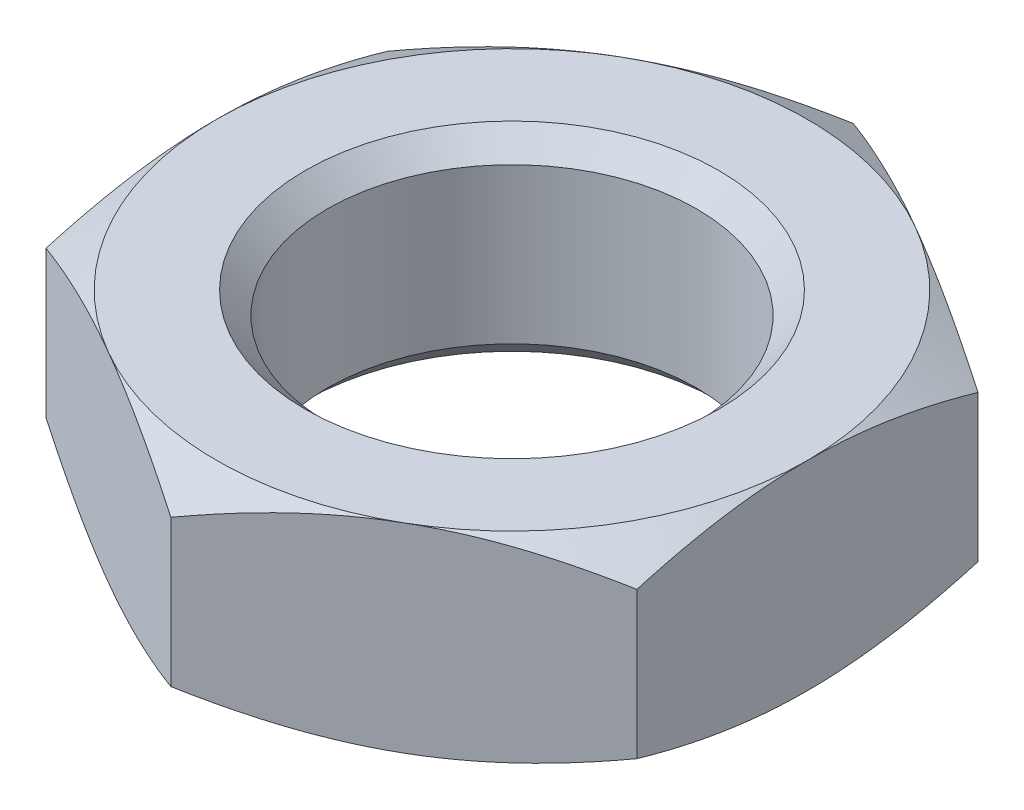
ISO-10303-21;
HEADER;
FILE_DESCRIPTION(('STEP AP214'),'2;1');
FILE_NAME('part.step','',(''),(''),'','','');
FILE_SCHEMA(('AUTOMOTIVE_DESIGN { 1 0 10303 214 1 1 1 1 }'));
ENDSEC;
DATA;
#1=APPLICATION_CONTEXT('core data for automotive mechanical design processes');
#2=APPLICATION_PROTOCOL_DEFINITION('international standard','automotive_design',2000,#1);
#3=PRODUCT_CONTEXT('',#1,'mechanical');
#4=PRODUCT('Part','Part','',(#3));
#5=PRODUCT_RELATED_PRODUCT_CATEGORY('part','',(#4));
#6=PRODUCT_DEFINITION_FORMATION('','',#4);
#7=PRODUCT_DEFINITION_CONTEXT('part definition',#1,'design');
#8=PRODUCT_DEFINITION('design','',#6,#7);
#9=PRODUCT_DEFINITION_SHAPE('','',#8);
#10=(LENGTH_UNIT() NAMED_UNIT(*) SI_UNIT(.MILLI.,.METRE.));
#11=(NAMED_UNIT(*) PLANE_ANGLE_UNIT() SI_UNIT($,.RADIAN.));
#12=(NAMED_UNIT(*) SI_UNIT($,.STERADIAN.) SOLID_ANGLE_UNIT());
#13=UNCERTAINTY_MEASURE_WITH_UNIT(LENGTH_MEASURE(1.E-05),#10,'distance_accuracy_value','');
#14=(GEOMETRIC_REPRESENTATION_CONTEXT(3) GLOBAL_UNCERTAINTY_ASSIGNED_CONTEXT((#13)) GLOBAL_UNIT_ASSIGNED_CONTEXT((#10,
#11,#12)) REPRESENTATION_CONTEXT('',''));
#15=CARTESIAN_POINT('',(0.,0.,0.));
#16=DIRECTION('',(0.,0.,1.));
#17=DIRECTION('',(1.,0.,0.));
#18=AXIS2_PLACEMENT_3D('',#15,#16,#17);
#19=CARTESIAN_POINT('',(-4.,1.35,-2.3094010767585));
#20=DIRECTION('',(0.,1.,0.));
#21=DIRECTION('',(0.,0.,1.));
#22=AXIS2_PLACEMENT_3D('',#19,#20,#21);
#23=PLANE('',#22);
#24=CARTESIAN_POINT('',(0.,1.35,0.));
#25=DIRECTION('',(0.,1.,0.));
#26=DIRECTION('',(0.,0.,1.));
#27=AXIS2_PLACEMENT_3D('',#24,#25,#26);
#28=CIRCLE('',#27,2.8);
#29=CARTESIAN_POINT('',(0.,1.35,2.8));
#30=VERTEX_POINT('',#29);
#31=EDGE_CURVE('E13',#30,#30,#28,.F.);
#32=ORIENTED_EDGE('',*,*,#31,.T.);
#33=EDGE_LOOP('',(#32));
#34=FACE_BOUND('',#33,.T.);
#35=CARTESIAN_POINT('',(0.,1.35,0.));
#36=DIRECTION('',(0.,1.,0.));
#37=DIRECTION('',(0.,0.,1.));
#38=AXIS2_PLACEMENT_3D('',#35,#36,#37);
#39=CIRCLE('',#38,4.);
#40=CARTESIAN_POINT('',(-2.,1.35,3.46410161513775));
#41=VERTEX_POINT('',#40);
#42=CARTESIAN_POINT('',(2.,1.35,3.46410161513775));
#43=VERTEX_POINT('',#42);
#44=EDGE_CURVE('E264',#41,#43,#39,.T.);
#45=ORIENTED_EDGE('',*,*,#44,.T.);
#46=CARTESIAN_POINT('',(4.,1.35,0.));
#47=VERTEX_POINT('',#46);
#48=EDGE_CURVE('E267',#43,#47,#39,.T.);
#49=ORIENTED_EDGE('',*,*,#48,.T.);
#50=CARTESIAN_POINT('',(2.,1.35,-3.46410161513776));
#51=VERTEX_POINT('',#50);
#52=EDGE_CURVE('E276',#47,#51,#39,.T.);
#53=ORIENTED_EDGE('',*,*,#52,.T.);
#54=CARTESIAN_POINT('',(-2.,1.35,-3.46410161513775));
#55=VERTEX_POINT('',#54);
#56=EDGE_CURVE('E278',#51,#55,#39,.T.);
#57=ORIENTED_EDGE('',*,*,#56,.T.);
#58=CARTESIAN_POINT('',(-4.,1.35,0.));
#59=VERTEX_POINT('',#58);
#60=EDGE_CURVE('E273',#55,#59,#39,.T.);
#61=ORIENTED_EDGE('',*,*,#60,.T.);
#62=EDGE_CURVE('E269',#59,#41,#39,.T.);
#63=ORIENTED_EDGE('',*,*,#62,.T.);
#64=EDGE_LOOP('',(#45,#49,#53,#57,#61,#63));
#65=FACE_BOUND('',#64,.T.);
#66=ADVANCED_FACE('F39',(#34,#65),#23,.T.);
#67=CARTESIAN_POINT('',(0.,1.35,-4.61880215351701));
#68=DIRECTION('',(0.5,0.,0.866025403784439));
#69=DIRECTION('',(0.866025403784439,0.,-0.5));
#70=AXIS2_PLACEMENT_3D('',#67,#68,#69);
#71=PLANE('',#70);
#72=DIRECTION('',(0.,-1.,0.));
#73=VECTOR('',#72,1.);
#74=CARTESIAN_POINT('',(0.,1.35,-4.61880215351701));
#75=LINE('',#74,#73);
#76=CARTESIAN_POINT('',(0.,0.992734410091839,-4.61880215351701));
#77=VERTEX_POINT('',#76);
#78=CARTESIAN_POINT('',(0.,-0.992734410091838,-4.61880215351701));
#79=VERTEX_POINT('',#78);
#80=EDGE_CURVE('E297',#77,#79,#75,.T.);
#81=ORIENTED_EDGE('',*,*,#80,.T.);
#82=CARTESIAN_POINT('',(0.000199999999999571,-0.992667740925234,-4.61891762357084));
#83=CARTESIAN_POINT('',(-0.175579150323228,-1.05128212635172,-4.51743148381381));
#84=CARTESIAN_POINT('',(-0.352875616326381,-1.10458967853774,-4.41506932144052));
#85=CARTESIAN_POINT('',(-0.710538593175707,-1.1976383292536,-4.20857250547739));
#86=CARTESIAN_POINT('',(-0.890911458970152,-1.2373465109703,-4.10443418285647));
#87=CARTESIAN_POINT('',(-1.24942181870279,-1.29915778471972,-3.89744813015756));
#88=CARTESIAN_POINT('',(-1.42750415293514,-1.32167226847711,-3.79463224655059));
#89=CARTESIAN_POINT('',(-1.78450671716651,-1.34854937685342,-3.58851671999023));
#90=CARTESIAN_POINT('',(-1.9634256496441,-1.35293425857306,-3.48521782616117));
#91=CARTESIAN_POINT('',(-2.29774284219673,-1.34380992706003,-3.29219970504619));
#92=CARTESIAN_POINT('',(-2.45319115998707,-1.33254104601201,-3.20245157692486));
#93=CARTESIAN_POINT('',(-2.76307505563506,-1.29682600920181,-3.02354002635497));
#94=CARTESIAN_POINT('',(-2.91750956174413,-1.27236765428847,-2.93437722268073));
#95=CARTESIAN_POINT('',(-3.22803232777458,-1.21122393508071,-2.75509682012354));
#96=CARTESIAN_POINT('',(-3.3840812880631,-1.17427939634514,-2.6650019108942));
#97=CARTESIAN_POINT('',(-3.69385183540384,-1.09042992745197,-2.48615580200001));
#98=CARTESIAN_POINT('',(-3.84757739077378,-1.04354469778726,-2.39740231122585));
#99=CARTESIAN_POINT('',(-4.0002,-0.992667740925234,-2.30928560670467));
#100=B_SPLINE_CURVE_WITH_KNOTS('',3,(#82,#83,#84,#85,#86,#87,#88,#89,#90,#91,#92,#93,#94,#95,
#96,#97,#98,#99),.UNSPECIFIED.,.F.,.F.,(4,2,2,2,2,2,2,2,4),(0.,0.634047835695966,
1.26961969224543,1.88946157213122,2.50854226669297,3.04757825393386,3.58711366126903,
4.13861653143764,4.68903648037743),.UNSPECIFIED.);
#101=CARTESIAN_POINT('',(-2.,-1.35,-3.46410161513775));
#102=VERTEX_POINT('',#101);
#103=EDGE_CURVE('E62',#79,#102,#100,.T.);
#104=ORIENTED_EDGE('',*,*,#103,.T.);
#105=CARTESIAN_POINT('',(-4.,-0.992734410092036,-2.3094010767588));
#106=VERTEX_POINT('',#105);
#107=EDGE_CURVE('E201',#102,#106,#100,.T.);
#108=ORIENTED_EDGE('',*,*,#107,.T.);
#109=DIRECTION('',(0.,-1.,0.));
#110=VECTOR('',#109,1.);
#111=CARTESIAN_POINT('',(-4.,1.35,-2.3094010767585));
#112=LINE('',#111,#110);
#113=CARTESIAN_POINT('',(-4.,0.992734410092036,-2.3094010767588));
#114=VERTEX_POINT('',#113);
#115=EDGE_CURVE('E232',#114,#106,#112,.T.);
#116=ORIENTED_EDGE('',*,*,#115,.F.);
#117=CARTESIAN_POINT('',(0.000199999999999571,0.992667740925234,-4.61891762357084));
#118=CARTESIAN_POINT('',(-0.175579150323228,1.05128212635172,-4.51743148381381));
#119=CARTESIAN_POINT('',(-0.352875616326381,1.10458967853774,-4.41506932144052));
#120=CARTESIAN_POINT('',(-0.710538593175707,1.1976383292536,-4.20857250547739));
#121=CARTESIAN_POINT('',(-0.890911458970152,1.2373465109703,-4.10443418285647));
#122=CARTESIAN_POINT('',(-1.24942181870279,1.29915778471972,-3.89744813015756));
#123=CARTESIAN_POINT('',(-1.42750415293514,1.32167226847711,-3.79463224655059));
#124=CARTESIAN_POINT('',(-1.78450671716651,1.34854937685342,-3.58851671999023));
#125=CARTESIAN_POINT('',(-1.9634256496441,1.35293425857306,-3.48521782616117));
#126=CARTESIAN_POINT('',(-2.29774284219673,1.34380992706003,-3.29219970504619));
#127=CARTESIAN_POINT('',(-2.45319115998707,1.33254104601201,-3.20245157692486));
#128=CARTESIAN_POINT('',(-2.76307505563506,1.29682600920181,-3.02354002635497));
#129=CARTESIAN_POINT('',(-2.91750956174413,1.27236765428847,-2.93437722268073));
#130=CARTESIAN_POINT('',(-3.22803232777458,1.21122393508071,-2.75509682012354));
#131=CARTESIAN_POINT('',(-3.3840812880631,1.17427939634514,-2.6650019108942));
#132=CARTESIAN_POINT('',(-3.69385183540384,1.09042992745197,-2.48615580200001));
#133=CARTESIAN_POINT('',(-3.84757739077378,1.04354469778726,-2.39740231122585));
#134=CARTESIAN_POINT('',(-4.0002,0.992667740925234,-2.30928560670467));
#135=B_SPLINE_CURVE_WITH_KNOTS('',3,(#117,#118,#119,#120,#121,#122,#123,#124,#125,#126,#127,
#128,#129,#130,#131,#132,#133,#134),.UNSPECIFIED.,.F.,.F.,(4,2,2,2,2,2,2,2,4),(0.,
0.634047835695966,1.26961969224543,1.88946157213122,2.50854226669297,3.04757825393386,
3.58711366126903,4.13861653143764,4.68903648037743),.UNSPECIFIED.);
#136=EDGE_CURVE('E286',#55,#114,#135,.T.);
#137=ORIENTED_EDGE('',*,*,#136,.F.);
#138=EDGE_CURVE('E292',#77,#55,#135,.T.);
#139=ORIENTED_EDGE('',*,*,#138,.F.);
#140=EDGE_LOOP('',(#81,#104,#108,#116,#137,#139));
#141=FACE_BOUND('',#140,.T.);
#142=ADVANCED_FACE('F260',(#141),#71,.F.);
#143=CARTESIAN_POINT('',(-4.,1.35,-2.3094010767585));
#144=DIRECTION('',(1.,0.,0.));
#145=DIRECTION('',(0.,0.,-1.));
#146=AXIS2_PLACEMENT_3D('',#143,#144,#145);
#147=PLANE('',#146);
#148=ORIENTED_EDGE('',*,*,#115,.T.);
#149=CARTESIAN_POINT('',(-4.,0.631410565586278,-6.26364060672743));
#150=CARTESIAN_POINT('',(-4.,0.546160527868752,-6.08839609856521));
#151=CARTESIAN_POINT('',(-4.,0.461710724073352,-5.91275567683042));
#152=CARTESIAN_POINT('',(-4.,0.294860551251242,-5.56047264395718));
#153=CARTESIAN_POINT('',(-4.,0.212460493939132,-5.38382988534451));
#154=CARTESIAN_POINT('',(-4.,0.049757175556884,-5.02845058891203));
#155=CARTESIAN_POINT('',(-4.,-0.0305327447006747,-4.84970792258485));
#156=CARTESIAN_POINT('',(-4.,-0.187905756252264,-4.49082161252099));
#157=CARTESIAN_POINT('',(-4.,-0.264988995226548,-4.31067803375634));
#158=CARTESIAN_POINT('',(-4.,-0.417589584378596,-3.94270963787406));
#159=CARTESIAN_POINT('',(-4.,-0.492970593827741,-3.75482797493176));
#160=CARTESIAN_POINT('',(-4.,-0.638172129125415,-3.37688904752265));
#161=CARTESIAN_POINT('',(-4.,-0.707992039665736,-3.18683154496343));
#162=CARTESIAN_POINT('',(-4.,-0.840282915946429,-2.80457501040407));
#163=CARTESIAN_POINT('',(-4.,-0.902768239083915,-2.61238099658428));
#164=CARTESIAN_POINT('',(-4.,-1.01842502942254,-2.22523670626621));
#165=CARTESIAN_POINT('',(-4.,-1.07159936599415,-2.03028729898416));
#166=CARTESIAN_POINT('',(-4.,-1.16584253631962,-1.63859092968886));
#167=CARTESIAN_POINT('',(-4.,-1.20697772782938,-1.44186022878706));
#168=CARTESIAN_POINT('',(-4.,-1.27485208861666,-1.04589060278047));
#169=CARTESIAN_POINT('',(-4.,-1.30159276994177,-0.846651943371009));
#170=CARTESIAN_POINT('',(-4.,-1.33819755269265,-0.44928920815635));
#171=CARTESIAN_POINT('',(-4.,-1.3482833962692,-0.251186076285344));
#172=CARTESIAN_POINT('',(-4.,-1.35131106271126,0.145171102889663));
#173=CARTESIAN_POINT('',(-4.,-1.34425255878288,0.343425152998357));
#174=CARTESIAN_POINT('',(-4.,-1.31836369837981,0.678191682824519));
#175=CARTESIAN_POINT('',(-4.,-1.30379065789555,0.815054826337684));
#176=CARTESIAN_POINT('',(-4.,-1.26734873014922,1.08781279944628));
#177=CARTESIAN_POINT('',(-4.,-1.24547890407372,1.22370750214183));
#178=CARTESIAN_POINT('',(-4.,-1.17007029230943,1.62973543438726));
#179=CARTESIAN_POINT('',(-4.,-1.10674461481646,1.89807310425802));
#180=CARTESIAN_POINT('',(-4.,-0.996488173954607,2.29948159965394));
#181=CARTESIAN_POINT('',(-4.,-0.956651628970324,2.43461973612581));
#182=CARTESIAN_POINT('',(-4.,-0.872732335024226,2.70358385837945));
#183=CARTESIAN_POINT('',(-4.,-0.828649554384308,2.83740983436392));
#184=CARTESIAN_POINT('',(-4.,-0.736954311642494,3.10379136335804));
#185=CARTESIAN_POINT('',(-4.,-0.689342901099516,3.23634728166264));
#186=CARTESIAN_POINT('',(-4.,-0.591161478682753,3.50035220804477));
#187=CARTESIAN_POINT('',(-4.,-0.540591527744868,3.63180123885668));
#188=CARTESIAN_POINT('',(-4.,-0.403732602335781,3.97777879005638));
#189=CARTESIAN_POINT('',(-4.,-0.315350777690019,4.19147854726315));
#190=CARTESIAN_POINT('',(-4.,-0.13359200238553,4.61675075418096));
#191=CARTESIAN_POINT('',(-4.,-0.0402145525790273,4.82832298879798));
#192=CARTESIAN_POINT('',(-4.,0.150380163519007,5.24980611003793));
#193=CARTESIAN_POINT('',(-4.,0.247598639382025,5.45971644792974));
#194=CARTESIAN_POINT('',(-4.,0.444989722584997,5.87814640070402));
#195=CARTESIAN_POINT('',(-4.,0.545162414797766,6.08666597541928));
#196=CARTESIAN_POINT('',(-4.,0.74797675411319,6.50287730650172));
#197=CARTESIAN_POINT('',(-4.,0.850621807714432,6.71056739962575));
#198=CARTESIAN_POINT('',(-4.,1.05777215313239,7.12501876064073));
#199=CARTESIAN_POINT('',(-4.,1.16227746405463,7.33178001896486));
#200=CARTESIAN_POINT('',(-4.,1.47798432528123,7.95083902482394));
#201=CARTESIAN_POINT('',(-4.,1.69141887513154,8.36199752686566));
#202=CARTESIAN_POINT('',(-4.,2.10036163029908,9.14044486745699));
#203=CARTESIAN_POINT('',(-4.,2.29548251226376,9.50793815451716));
#204=CARTESIAN_POINT('',(-4.,2.68811453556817,10.2416714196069));
#205=CARTESIAN_POINT('',(-4.,2.88562581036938,10.6079113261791));
#206=CARTESIAN_POINT('',(-4.,3.28179490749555,11.3382642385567));
#207=CARTESIAN_POINT('',(-4.,3.48044709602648,11.7023803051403));
#208=CARTESIAN_POINT('',(-4.,3.87911914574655,12.4298283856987));
#209=CARTESIAN_POINT('',(-4.,4.07913890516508,12.7931604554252));
#210=CARTESIAN_POINT('',(-4.,4.27965825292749,13.1562148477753));
#211=B_SPLINE_CURVE_WITH_KNOTS('',3,(#149,#150,#151,#152,#153,#154,#155,#156,#157,#158,#159,
#160,#161,#162,#163,#164,#165,#166,#167,#168,#169,#170,#171,#172,#173,#174,#175,#176,#177,#178,
#179,#180,#181,#182,#183,#184,#185,#186,#187,#188,#189,#190,#191,#192,#193,#194,#195,#196,#197,
#198,#199,#200,#201,#202,#203,#204,#205,#206,#207,#208,#209,#210),.UNSPECIFIED.,.F.,.F.,(4,2,2,
2,2,2,2,2,2,2,2,2,2,2,2,2,2,2,2,2,2,2,2,2,2,2,2,2,2,2,4),(0.,0.584646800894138,1.16938197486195,
1.75719913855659,2.34498920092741,2.95224010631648,3.55955810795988,4.16566673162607,
4.77158824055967,5.37410424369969,5.97655694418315,6.57092195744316,7.16529830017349,
7.57800978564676,7.99077439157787,8.81672145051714,9.23934625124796,9.6619742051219,
10.0844767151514,10.5069705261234,11.2006424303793,11.8943837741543,12.5883453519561,
13.2823268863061,13.9773265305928,14.672333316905,16.0620609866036,17.3102952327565,
18.558599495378,19.802939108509,21.0471871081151),.UNSPECIFIED.);
#212=CARTESIAN_POINT('',(-4.,-1.35,0.));
#213=VERTEX_POINT('',#212);
#214=EDGE_CURVE('E332',#106,#213,#211,.T.);
#215=ORIENTED_EDGE('',*,*,#214,.T.);
#216=CARTESIAN_POINT('',(-4.,-0.992734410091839,2.3094010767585));
#217=VERTEX_POINT('',#216);
#218=EDGE_CURVE('E326',#213,#217,#211,.T.);
#219=ORIENTED_EDGE('',*,*,#218,.T.);
#220=DIRECTION('',(0.,-1.,0.));
#221=VECTOR('',#220,1.);
#222=CARTESIAN_POINT('',(-4.,1.35,2.3094010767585));
#223=LINE('',#222,#221);
#224=CARTESIAN_POINT('',(-4.,0.992734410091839,2.3094010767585));
#225=VERTEX_POINT('',#224);
#226=EDGE_CURVE('E338',#225,#217,#223,.T.);
#227=ORIENTED_EDGE('',*,*,#226,.F.);
#228=CARTESIAN_POINT('',(-4.,-0.631410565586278,-6.26364060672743));
#229=CARTESIAN_POINT('',(-4.,-0.546160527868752,-6.08839609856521));
#230=CARTESIAN_POINT('',(-4.,-0.461710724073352,-5.91275567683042));
#231=CARTESIAN_POINT('',(-4.,-0.294860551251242,-5.56047264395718));
#232=CARTESIAN_POINT('',(-4.,-0.212460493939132,-5.38382988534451));
#233=CARTESIAN_POINT('',(-4.,-0.049757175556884,-5.02845058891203));
#234=CARTESIAN_POINT('',(-4.,0.0305327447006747,-4.84970792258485));
#235=CARTESIAN_POINT('',(-4.,0.187905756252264,-4.49082161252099));
#236=CARTESIAN_POINT('',(-4.,0.264988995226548,-4.31067803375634));
#237=CARTESIAN_POINT('',(-4.,0.417589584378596,-3.94270963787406));
#238=CARTESIAN_POINT('',(-4.,0.492970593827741,-3.75482797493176));
#239=CARTESIAN_POINT('',(-4.,0.638172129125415,-3.37688904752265));
#240=CARTESIAN_POINT('',(-4.,0.707992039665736,-3.18683154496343));
#241=CARTESIAN_POINT('',(-4.,0.840282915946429,-2.80457501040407));
#242=CARTESIAN_POINT('',(-4.,0.902768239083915,-2.61238099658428));
#243=CARTESIAN_POINT('',(-4.,1.01842502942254,-2.22523670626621));
#244=CARTESIAN_POINT('',(-4.,1.07159936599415,-2.03028729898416));
#245=CARTESIAN_POINT('',(-4.,1.16584253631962,-1.63859092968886));
#246=CARTESIAN_POINT('',(-4.,1.20697772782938,-1.44186022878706));
#247=CARTESIAN_POINT('',(-4.,1.27485208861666,-1.04589060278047));
#248=CARTESIAN_POINT('',(-4.,1.30159276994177,-0.846651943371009));
#249=CARTESIAN_POINT('',(-4.,1.33819755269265,-0.44928920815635));
#250=CARTESIAN_POINT('',(-4.,1.3482833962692,-0.251186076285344));
#251=CARTESIAN_POINT('',(-4.,1.35131106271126,0.145171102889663));
#252=CARTESIAN_POINT('',(-4.,1.34425255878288,0.343425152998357));
#253=CARTESIAN_POINT('',(-4.,1.31836369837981,0.678191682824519));
#254=CARTESIAN_POINT('',(-4.,1.30379065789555,0.815054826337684));
#255=CARTESIAN_POINT('',(-4.,1.26734873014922,1.08781279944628));
#256=CARTESIAN_POINT('',(-4.,1.24547890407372,1.22370750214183));
#257=CARTESIAN_POINT('',(-4.,1.17007029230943,1.62973543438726));
#258=CARTESIAN_POINT('',(-4.,1.10674461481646,1.89807310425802));
#259=CARTESIAN_POINT('',(-4.,0.996488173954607,2.29948159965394));
#260=CARTESIAN_POINT('',(-4.,0.956651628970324,2.43461973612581));
#261=CARTESIAN_POINT('',(-4.,0.872732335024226,2.70358385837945));
#262=CARTESIAN_POINT('',(-4.,0.828649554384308,2.83740983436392));
#263=CARTESIAN_POINT('',(-4.,0.736954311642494,3.10379136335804));
#264=CARTESIAN_POINT('',(-4.,0.689342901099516,3.23634728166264));
#265=CARTESIAN_POINT('',(-4.,0.591161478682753,3.50035220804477));
#266=CARTESIAN_POINT('',(-4.,0.540591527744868,3.63180123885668));
#267=CARTESIAN_POINT('',(-4.,0.403732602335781,3.97777879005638));
#268=CARTESIAN_POINT('',(-4.,0.315350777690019,4.19147854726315));
#269=CARTESIAN_POINT('',(-4.,0.13359200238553,4.61675075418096));
#270=CARTESIAN_POINT('',(-4.,0.0402145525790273,4.82832298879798));
#271=CARTESIAN_POINT('',(-4.,-0.150380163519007,5.24980611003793));
#272=CARTESIAN_POINT('',(-4.,-0.247598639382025,5.45971644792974));
#273=CARTESIAN_POINT('',(-4.,-0.444989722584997,5.87814640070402));
#274=CARTESIAN_POINT('',(-4.,-0.545162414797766,6.08666597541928));
#275=CARTESIAN_POINT('',(-4.,-0.74797675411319,6.50287730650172));
#276=CARTESIAN_POINT('',(-4.,-0.850621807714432,6.71056739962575));
#277=CARTESIAN_POINT('',(-4.,-1.05777215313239,7.12501876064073));
#278=CARTESIAN_POINT('',(-4.,-1.16227746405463,7.33178001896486));
#279=CARTESIAN_POINT('',(-4.,-1.47798432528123,7.95083902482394));
#280=CARTESIAN_POINT('',(-4.,-1.69141887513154,8.36199752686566));
#281=CARTESIAN_POINT('',(-4.,-2.10036163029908,9.14044486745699));
#282=CARTESIAN_POINT('',(-4.,-2.29548251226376,9.50793815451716));
#283=CARTESIAN_POINT('',(-4.,-2.68811453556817,10.2416714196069));
#284=CARTESIAN_POINT('',(-4.,-2.88562581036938,10.6079113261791));
#285=CARTESIAN_POINT('',(-4.,-3.28179490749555,11.3382642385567));
#286=CARTESIAN_POINT('',(-4.,-3.48044709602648,11.7023803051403));
#287=CARTESIAN_POINT('',(-4.,-3.87911914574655,12.4298283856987));
#288=CARTESIAN_POINT('',(-4.,-4.07913890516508,12.7931604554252));
#289=CARTESIAN_POINT('',(-4.,-4.27965825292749,13.1562148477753));
#290=B_SPLINE_CURVE_WITH_KNOTS('',3,(#228,#229,#230,#231,#232,#233,#234,#235,#236,#237,#238,
#239,#240,#241,#242,#243,#244,#245,#246,#247,#248,#249,#250,#251,#252,#253,#254,#255,#256,#257,
#258,#259,#260,#261,#262,#263,#264,#265,#266,#267,#268,#269,#270,#271,#272,#273,#274,#275,#276,
#277,#278,#279,#280,#281,#282,#283,#284,#285,#286,#287,#288,#289),.UNSPECIFIED.,.F.,.F.,(4,2,2,
2,2,2,2,2,2,2,2,2,2,2,2,2,2,2,2,2,2,2,2,2,2,2,2,2,2,2,4),(0.,0.584646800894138,1.16938197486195,
1.75719913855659,2.34498920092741,2.95224010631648,3.55955810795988,4.16566673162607,
4.77158824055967,5.37410424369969,5.97655694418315,6.57092195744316,7.16529830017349,
7.57800978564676,7.99077439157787,8.81672145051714,9.23934625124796,9.6619742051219,
10.0844767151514,10.5069705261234,11.2006424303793,11.8943837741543,12.5883453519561,
13.2823268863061,13.9773265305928,14.672333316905,16.0620609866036,17.3102952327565,
18.558599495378,19.802939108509,21.0471871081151),.UNSPECIFIED.);
#291=EDGE_CURVE('E302',#59,#225,#290,.T.);
#292=ORIENTED_EDGE('',*,*,#291,.F.);
#293=EDGE_CURVE('E288',#114,#59,#290,.T.);
#294=ORIENTED_EDGE('',*,*,#293,.F.);
#295=EDGE_LOOP('',(#148,#215,#219,#227,#292,#294));
#296=FACE_BOUND('',#295,.T.);
#297=ADVANCED_FACE('F318',(#296),#147,.F.);
#298=CARTESIAN_POINT('',(-4.,1.35,2.3094010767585));
#299=DIRECTION('',(0.5,0.,-0.866025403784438));
#300=DIRECTION('',(-0.866025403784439,0.,-0.5));
#301=AXIS2_PLACEMENT_3D('',#298,#299,#300);
#302=PLANE('',#301);
#303=ORIENTED_EDGE('',*,*,#226,.T.);
#304=CARTESIAN_POINT('',(-4.0002,-0.992667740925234,2.30928560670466));
#305=CARTESIAN_POINT('',(-3.82442084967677,-1.05128212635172,2.4107717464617));
#306=CARTESIAN_POINT('',(-3.64712438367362,-1.10458967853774,2.51313390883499));
#307=CARTESIAN_POINT('',(-3.28946140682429,-1.1976383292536,2.71963072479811));
#308=CARTESIAN_POINT('',(-3.10908854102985,-1.2373465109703,2.82376904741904));
#309=CARTESIAN_POINT('',(-2.75057818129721,-1.29915778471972,3.03075510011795));
#310=CARTESIAN_POINT('',(-2.57249584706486,-1.32167226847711,3.13357098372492));
#311=CARTESIAN_POINT('',(-2.21549328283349,-1.34854937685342,3.33968651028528));
#312=CARTESIAN_POINT('',(-2.0365743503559,-1.35293425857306,3.44298540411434));
#313=CARTESIAN_POINT('',(-1.70225715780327,-1.34380992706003,3.63600352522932));
#314=CARTESIAN_POINT('',(-1.54680884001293,-1.33254104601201,3.72575165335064));
#315=CARTESIAN_POINT('',(-1.23692494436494,-1.29682600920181,3.90466320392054));
#316=CARTESIAN_POINT('',(-1.08249043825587,-1.27236765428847,3.99382600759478));
#317=CARTESIAN_POINT('',(-0.771967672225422,-1.21122393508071,4.17310641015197));
#318=CARTESIAN_POINT('',(-0.615918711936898,-1.17427939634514,4.26320131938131));
#319=CARTESIAN_POINT('',(-0.30614816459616,-1.09042992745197,4.4420474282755));
#320=CARTESIAN_POINT('',(-0.15242260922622,-1.04354469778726,4.53080091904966));
#321=CARTESIAN_POINT('',(0.000200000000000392,-0.992667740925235,4.61891762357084));
#322=B_SPLINE_CURVE_WITH_KNOTS('',3,(#304,#305,#306,#307,#308,#309,#310,#311,#312,#313,#314,
#315,#316,#317,#318,#319,#320,#321),.UNSPECIFIED.,.F.,.F.,(4,2,2,2,2,2,2,2,4),(0.,
0.634047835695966,1.26961969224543,1.88946157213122,2.50854226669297,3.04757825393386,
3.58711366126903,4.13861653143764,4.68903648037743),.UNSPECIFIED.);
#323=CARTESIAN_POINT('',(-2.,-1.35,3.46410161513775));
#324=VERTEX_POINT('',#323);
#325=EDGE_CURVE('E164',#217,#324,#322,.T.);
#326=ORIENTED_EDGE('',*,*,#325,.T.);
#327=CARTESIAN_POINT('',(0.,-0.992734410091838,4.61880215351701));
#328=VERTEX_POINT('',#327);
#329=EDGE_CURVE('E148',#324,#328,#322,.T.);
#330=ORIENTED_EDGE('',*,*,#329,.T.);
#331=DIRECTION('',(0.,-1.,0.));
#332=VECTOR('',#331,1.);
#333=CARTESIAN_POINT('',(0.,1.35,4.61880215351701));
#334=LINE('',#333,#332);
#335=CARTESIAN_POINT('',(0.,0.992734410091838,4.61880215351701));
#336=VERTEX_POINT('',#335);
#337=EDGE_CURVE('E163',#336,#328,#334,.T.);
#338=ORIENTED_EDGE('',*,*,#337,.F.);
#339=CARTESIAN_POINT('',(-4.0002,0.992667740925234,2.30928560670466));
#340=CARTESIAN_POINT('',(-3.82442084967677,1.05128212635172,2.4107717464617));
#341=CARTESIAN_POINT('',(-3.64712438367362,1.10458967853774,2.51313390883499));
#342=CARTESIAN_POINT('',(-3.28946140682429,1.1976383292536,2.71963072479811));
#343=CARTESIAN_POINT('',(-3.10908854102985,1.2373465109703,2.82376904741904));
#344=CARTESIAN_POINT('',(-2.75057818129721,1.29915778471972,3.03075510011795));
#345=CARTESIAN_POINT('',(-2.57249584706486,1.32167226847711,3.13357098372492));
#346=CARTESIAN_POINT('',(-2.21549328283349,1.34854937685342,3.33968651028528));
#347=CARTESIAN_POINT('',(-2.0365743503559,1.35293425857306,3.44298540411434));
#348=CARTESIAN_POINT('',(-1.70225715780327,1.34380992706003,3.63600352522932));
#349=CARTESIAN_POINT('',(-1.54680884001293,1.33254104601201,3.72575165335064));
#350=CARTESIAN_POINT('',(-1.23692494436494,1.29682600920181,3.90466320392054));
#351=CARTESIAN_POINT('',(-1.08249043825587,1.27236765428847,3.99382600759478));
#352=CARTESIAN_POINT('',(-0.771967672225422,1.21122393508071,4.17310641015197));
#353=CARTESIAN_POINT('',(-0.615918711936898,1.17427939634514,4.26320131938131));
#354=CARTESIAN_POINT('',(-0.30614816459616,1.09042992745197,4.4420474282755));
#355=CARTESIAN_POINT('',(-0.15242260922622,1.04354469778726,4.53080091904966));
#356=CARTESIAN_POINT('',(0.000200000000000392,0.992667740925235,4.61891762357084));
#357=B_SPLINE_CURVE_WITH_KNOTS('',3,(#339,#340,#341,#342,#343,#344,#345,#346,#347,#348,#349,
#350,#351,#352,#353,#354,#355,#356),.UNSPECIFIED.,.F.,.F.,(4,2,2,2,2,2,2,2,4),(0.,
0.634047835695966,1.26961969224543,1.88946157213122,2.50854226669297,3.04757825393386,
3.58711366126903,4.13861653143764,4.68903648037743),.UNSPECIFIED.);
#358=EDGE_CURVE('E364',#41,#336,#357,.T.);
#359=ORIENTED_EDGE('',*,*,#358,.F.);
#360=EDGE_CURVE('E386',#225,#41,#357,.T.);
#361=ORIENTED_EDGE('',*,*,#360,.F.);
#362=EDGE_LOOP('',(#303,#326,#330,#338,#359,#361));
#363=FACE_BOUND('',#362,.T.);
#364=ADVANCED_FACE('F322',(#363),#302,.F.);
#365=CARTESIAN_POINT('',(0.,1.35,4.61880215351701));
#366=DIRECTION('',(-0.5,0.,-0.866025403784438));
#367=DIRECTION('',(-0.866025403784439,0.,0.5));
#368=AXIS2_PLACEMENT_3D('',#365,#366,#367);
#369=PLANE('',#368);
#370=ORIENTED_EDGE('',*,*,#337,.T.);
#371=CARTESIAN_POINT('',(-0.000199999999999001,-0.992667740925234,4.61891762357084));
#372=CARTESIAN_POINT('',(0.175579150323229,-1.05128212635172,4.51743148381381));
#373=CARTESIAN_POINT('',(0.352875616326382,-1.10458967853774,4.41506932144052));
#374=CARTESIAN_POINT('',(0.710538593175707,-1.1976383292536,4.20857250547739));
#375=CARTESIAN_POINT('',(0.890911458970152,-1.2373465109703,4.10443418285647));
#376=CARTESIAN_POINT('',(1.24942181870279,-1.29915778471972,3.89744813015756));
#377=CARTESIAN_POINT('',(1.42750415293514,-1.32167226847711,3.79463224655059));
#378=CARTESIAN_POINT('',(1.78450671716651,-1.34854937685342,3.58851671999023));
#379=CARTESIAN_POINT('',(1.9634256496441,-1.35293425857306,3.48521782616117));
#380=CARTESIAN_POINT('',(2.29774284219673,-1.34380992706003,3.29219970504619));
#381=CARTESIAN_POINT('',(2.45319115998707,-1.33254104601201,3.20245157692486));
#382=CARTESIAN_POINT('',(2.76307505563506,-1.29682600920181,3.02354002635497));
#383=CARTESIAN_POINT('',(2.91750956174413,-1.27236765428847,2.93437722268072));
#384=CARTESIAN_POINT('',(3.22803232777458,-1.21122393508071,2.75509682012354));
#385=CARTESIAN_POINT('',(3.3840812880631,-1.17427939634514,2.6650019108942));
#386=CARTESIAN_POINT('',(3.69385183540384,-1.09042992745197,2.48615580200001));
#387=CARTESIAN_POINT('',(3.84757739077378,-1.04354469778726,2.39740231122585));
#388=CARTESIAN_POINT('',(4.0002,-0.992667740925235,2.30928560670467));
#389=B_SPLINE_CURVE_WITH_KNOTS('',3,(#371,#372,#373,#374,#375,#376,#377,#378,#379,#380,#381,
#382,#383,#384,#385,#386,#387,#388),.UNSPECIFIED.,.F.,.F.,(4,2,2,2,2,2,2,2,4),(0.,
0.634047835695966,1.26961969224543,1.88946157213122,2.50854226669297,3.04757825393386,
3.58711366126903,4.13861653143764,4.68903648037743),.UNSPECIFIED.);
#390=CARTESIAN_POINT('',(2.,-1.35,3.46410161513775));
#391=VERTEX_POINT('',#390);
#392=EDGE_CURVE('E141',#328,#391,#389,.T.);
#393=ORIENTED_EDGE('',*,*,#392,.T.);
#394=CARTESIAN_POINT('',(4.,-0.992734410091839,2.3094010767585));
#395=VERTEX_POINT('',#394);
#396=EDGE_CURVE('E129',#391,#395,#389,.T.);
#397=ORIENTED_EDGE('',*,*,#396,.T.);
#398=DIRECTION('',(0.,-1.,0.));
#399=VECTOR('',#398,1.);
#400=CARTESIAN_POINT('',(4.,1.35,2.3094010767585));
#401=LINE('',#400,#399);
#402=CARTESIAN_POINT('',(4.,0.992734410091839,2.3094010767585));
#403=VERTEX_POINT('',#402);
#404=EDGE_CURVE('E344',#403,#395,#401,.T.);
#405=ORIENTED_EDGE('',*,*,#404,.F.);
#406=CARTESIAN_POINT('',(-0.000199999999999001,0.992667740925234,4.61891762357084));
#407=CARTESIAN_POINT('',(0.175579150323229,1.05128212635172,4.51743148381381));
#408=CARTESIAN_POINT('',(0.352875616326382,1.10458967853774,4.41506932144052));
#409=CARTESIAN_POINT('',(0.710538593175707,1.1976383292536,4.20857250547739));
#410=CARTESIAN_POINT('',(0.890911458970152,1.2373465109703,4.10443418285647));
#411=CARTESIAN_POINT('',(1.24942181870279,1.29915778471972,3.89744813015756));
#412=CARTESIAN_POINT('',(1.42750415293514,1.32167226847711,3.79463224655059));
#413=CARTESIAN_POINT('',(1.78450671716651,1.34854937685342,3.58851671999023));
#414=CARTESIAN_POINT('',(1.9634256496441,1.35293425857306,3.48521782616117));
#415=CARTESIAN_POINT('',(2.29774284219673,1.34380992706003,3.29219970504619));
#416=CARTESIAN_POINT('',(2.45319115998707,1.33254104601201,3.20245157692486));
#417=CARTESIAN_POINT('',(2.76307505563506,1.29682600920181,3.02354002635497));
#418=CARTESIAN_POINT('',(2.91750956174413,1.27236765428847,2.93437722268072));
#419=CARTESIAN_POINT('',(3.22803232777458,1.21122393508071,2.75509682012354));
#420=CARTESIAN_POINT('',(3.3840812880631,1.17427939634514,2.6650019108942));
#421=CARTESIAN_POINT('',(3.69385183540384,1.09042992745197,2.48615580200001));
#422=CARTESIAN_POINT('',(3.84757739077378,1.04354469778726,2.39740231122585));
#423=CARTESIAN_POINT('',(4.0002,0.992667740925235,2.30928560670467));
#424=B_SPLINE_CURVE_WITH_KNOTS('',3,(#406,#407,#408,#409,#410,#411,#412,#413,#414,#415,#416,
#417,#418,#419,#420,#421,#422,#423),.UNSPECIFIED.,.F.,.F.,(4,2,2,2,2,2,2,2,4),(0.,
0.634047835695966,1.26961969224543,1.88946157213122,2.50854226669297,3.04757825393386,
3.58711366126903,4.13861653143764,4.68903648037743),.UNSPECIFIED.);
#425=EDGE_CURVE('E358',#43,#403,#424,.T.);
#426=ORIENTED_EDGE('',*,*,#425,.F.);
#427=EDGE_CURVE('E359',#336,#43,#424,.T.);
#428=ORIENTED_EDGE('',*,*,#427,.F.);
#429=EDGE_LOOP('',(#370,#393,#397,#405,#426,#428));
#430=FACE_BOUND('',#429,.T.);
#431=ADVANCED_FACE('F160',(#430),#369,.F.);
#432=CARTESIAN_POINT('',(4.,1.35,2.3094010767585));
#433=DIRECTION('',(-1.,0.,0.));
#434=DIRECTION('',(0.,0.,1.));
#435=AXIS2_PLACEMENT_3D('',#432,#433,#434);
#436=PLANE('',#435);
#437=ORIENTED_EDGE('',*,*,#404,.T.);
#438=CARTESIAN_POINT('',(4.,0.631410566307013,-6.26364060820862));
#439=CARTESIAN_POINT('',(4.,0.546160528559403,-6.08839609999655));
#440=CARTESIAN_POINT('',(4.,0.461710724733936,-5.91275567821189));
#441=CARTESIAN_POINT('',(4.,0.294860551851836,-5.56047264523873));
#442=CARTESIAN_POINT('',(4.,0.212460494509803,-5.38382988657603));
#443=CARTESIAN_POINT('',(4.,0.0497571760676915,-5.02845059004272));
#444=CARTESIAN_POINT('',(4.,-0.0305327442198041,-4.84970792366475));
#445=CARTESIAN_POINT('',(4.,-0.18790575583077,-4.49082161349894));
#446=CARTESIAN_POINT('',(4.,-0.264988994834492,-4.31067803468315));
#447=CARTESIAN_POINT('',(4.,-0.417589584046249,-3.94270963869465));
#448=CARTESIAN_POINT('',(4.,-0.492970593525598,-3.75482797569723));
#449=CARTESIAN_POINT('',(4.,-0.638172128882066,-3.37688904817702));
#450=CARTESIAN_POINT('',(4.,-0.707992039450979,-3.1868315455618));
#451=CARTESIAN_POINT('',(4.,-0.84028291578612,-2.80457501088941));
#452=CARTESIAN_POINT('',(4.,-0.902768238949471,-2.61238099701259));
#453=CARTESIAN_POINT('',(4.,-1.0184250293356,-2.2252367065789));
#454=CARTESIAN_POINT('',(4.,-1.07159936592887,-2.03028729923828));
#455=CARTESIAN_POINT('',(4.,-1.16584253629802,-1.63859092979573));
#456=CARTESIAN_POINT('',(4.,-1.20697772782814,-1.44186022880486));
#457=CARTESIAN_POINT('',(4.,-1.27485208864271,-1.04589060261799));
#458=CARTESIAN_POINT('',(4.,-1.30159276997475,-0.846651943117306));
#459=CARTESIAN_POINT('',(4.,-1.33819755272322,-0.449289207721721));
#460=CARTESIAN_POINT('',(4.,-1.34828339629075,-0.251186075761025));
#461=CARTESIAN_POINT('',(4.,-1.3513110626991,0.145171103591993));
#462=CARTESIAN_POINT('',(4.,-1.34425255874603,0.343425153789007));
#463=CARTESIAN_POINT('',(4.,-1.31836369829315,0.67819168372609));
#464=CARTESIAN_POINT('',(4.,-1.30379065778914,0.815054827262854));
#465=CARTESIAN_POINT('',(4.,-1.26734873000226,1.08781280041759));
#466=CARTESIAN_POINT('',(4.,-1.24547890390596,1.22370750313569));
#467=CARTESIAN_POINT('',(4.,-1.17007029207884,1.62973543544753));
#468=CARTESIAN_POINT('',(4.,-1.10674461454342,1.89807310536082));
#469=CARTESIAN_POINT('',(4.,-0.996488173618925,2.29948160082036));
#470=CARTESIAN_POINT('',(4.,-0.956651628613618,2.43461973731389));
#471=CARTESIAN_POINT('',(4.,-0.872732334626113,2.70358385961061));
#472=CARTESIAN_POINT('',(4.,-0.828649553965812,2.8374098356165));
#473=CARTESIAN_POINT('',(4.,-0.736954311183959,3.1037913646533));
#474=CARTESIAN_POINT('',(4.,-0.689342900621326,3.23634728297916));
#475=CARTESIAN_POINT('',(4.,-0.591161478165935,3.50035220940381));
#476=CARTESIAN_POINT('',(4.,-0.540591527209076,3.63180124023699));
#477=CARTESIAN_POINT('',(4.,-0.403732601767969,3.97777879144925));
#478=CARTESIAN_POINT('',(4.,-0.315350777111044,4.19147854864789));
#479=CARTESIAN_POINT('',(4.,-0.133592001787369,4.61675075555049));
#480=CARTESIAN_POINT('',(4.,-0.0402145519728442,4.82832299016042));
#481=CARTESIAN_POINT('',(4.,0.150380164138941,5.24980611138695));
#482=CARTESIAN_POINT('',(4.,0.247598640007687,5.45971644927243));
#483=CARTESIAN_POINT('',(4.,0.444989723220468,5.8781464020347));
#484=CARTESIAN_POINT('',(4.,0.545162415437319,6.0866659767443));
#485=CARTESIAN_POINT('',(4.,0.747976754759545,6.5028773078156));
#486=CARTESIAN_POINT('',(4.,0.850621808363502,6.71056740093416));
#487=CARTESIAN_POINT('',(4.,1.05777215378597,7.12501876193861));
#488=CARTESIAN_POINT('',(4.,1.16227746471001,7.33178002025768));
#489=CARTESIAN_POINT('',(4.,1.47798432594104,7.95083902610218));
#490=CARTESIAN_POINT('',(4.,1.69141887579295,8.36199752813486));
#491=CARTESIAN_POINT('',(4.,2.10036163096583,9.14044486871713));
#492=CARTESIAN_POINT('',(4.,2.29548251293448,9.50793815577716));
#493=CARTESIAN_POINT('',(4.,2.688114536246,10.241671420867));
#494=CARTESIAN_POINT('',(4.,2.88562581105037,10.6079113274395));
#495=CARTESIAN_POINT('',(4.,3.28179490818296,11.3382642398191));
#496=CARTESIAN_POINT('',(4.,3.48044709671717,11.7023803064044));
#497=CARTESIAN_POINT('',(4.,3.87911914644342,12.4298283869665));
#498=CARTESIAN_POINT('',(4.,4.07913890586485,12.793160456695));
#499=CARTESIAN_POINT('',(4.,4.27965825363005,13.1562148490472));
#500=B_SPLINE_CURVE_WITH_KNOTS('',3,(#438,#439,#440,#441,#442,#443,#444,#445,#446,#447,#448,
#449,#450,#451,#452,#453,#454,#455,#456,#457,#458,#459,#460,#461,#462,#463,#464,#465,#466,#467,
#468,#469,#470,#471,#472,#473,#474,#475,#476,#477,#478,#479,#480,#481,#482,#483,#484,#485,#486,
#487,#488,#489,#490,#491,#492,#493,#494,#495,#496,#497,#498,#499),.UNSPECIFIED.,.F.,.F.,(4,2,2,
2,2,2,2,2,2,2,2,2,2,2,2,2,2,2,2,2,2,2,2,2,2,2,2,2,2,2,4),(0.,0.584646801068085,1.16938197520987,
1.75719913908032,2.34498920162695,2.95224010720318,3.55955810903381,4.1656667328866,
4.77158824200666,5.37410424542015,5.97655694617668,6.570921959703,7.16529830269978,
7.57800978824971,7.99077439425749,8.81672145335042,9.23934625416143,9.66197420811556,
10.084476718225,10.506970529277,11.2006424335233,11.8943837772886,12.5883453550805,
13.2823268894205,13.9773265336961,14.6723333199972,16.062060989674,17.3102952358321,
18.5585994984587,19.8029391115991,21.0471871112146),.UNSPECIFIED.);
#501=CARTESIAN_POINT('',(4.,-1.35,0.));
#502=VERTEX_POINT('',#501);
#503=EDGE_CURVE('E136',#395,#502,#500,.F.);
#504=ORIENTED_EDGE('',*,*,#503,.T.);
#505=CARTESIAN_POINT('',(4.,-0.992734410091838,-2.3094010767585));
#506=VERTEX_POINT('',#505);
#507=EDGE_CURVE('E173',#502,#506,#500,.F.);
#508=ORIENTED_EDGE('',*,*,#507,.T.);
#509=DIRECTION('',(0.,-1.,0.));
#510=VECTOR('',#509,1.);
#511=CARTESIAN_POINT('',(4.,1.35,-2.3094010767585));
#512=LINE('',#511,#510);
#513=CARTESIAN_POINT('',(4.,0.992734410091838,-2.3094010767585));
#514=VERTEX_POINT('',#513);
#515=EDGE_CURVE('E347',#514,#506,#512,.T.);
#516=ORIENTED_EDGE('',*,*,#515,.F.);
#517=CARTESIAN_POINT('',(4.,-0.631410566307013,-6.26364060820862));
#518=CARTESIAN_POINT('',(4.,-0.546160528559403,-6.08839609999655));
#519=CARTESIAN_POINT('',(4.,-0.461710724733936,-5.91275567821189));
#520=CARTESIAN_POINT('',(4.,-0.294860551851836,-5.56047264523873));
#521=CARTESIAN_POINT('',(4.,-0.212460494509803,-5.38382988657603));
#522=CARTESIAN_POINT('',(4.,-0.0497571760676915,-5.02845059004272));
#523=CARTESIAN_POINT('',(4.,0.0305327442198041,-4.84970792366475));
#524=CARTESIAN_POINT('',(4.,0.18790575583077,-4.49082161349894));
#525=CARTESIAN_POINT('',(4.,0.264988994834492,-4.31067803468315));
#526=CARTESIAN_POINT('',(4.,0.417589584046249,-3.94270963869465));
#527=CARTESIAN_POINT('',(4.,0.492970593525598,-3.75482797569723));
#528=CARTESIAN_POINT('',(4.,0.638172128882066,-3.37688904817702));
#529=CARTESIAN_POINT('',(4.,0.707992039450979,-3.1868315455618));
#530=CARTESIAN_POINT('',(4.,0.84028291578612,-2.80457501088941));
#531=CARTESIAN_POINT('',(4.,0.902768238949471,-2.61238099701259));
#532=CARTESIAN_POINT('',(4.,1.0184250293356,-2.2252367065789));
#533=CARTESIAN_POINT('',(4.,1.07159936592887,-2.03028729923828));
#534=CARTESIAN_POINT('',(4.,1.16584253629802,-1.63859092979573));
#535=CARTESIAN_POINT('',(4.,1.20697772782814,-1.44186022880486));
#536=CARTESIAN_POINT('',(4.,1.27485208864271,-1.04589060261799));
#537=CARTESIAN_POINT('',(4.,1.30159276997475,-0.846651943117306));
#538=CARTESIAN_POINT('',(4.,1.33819755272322,-0.449289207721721));
#539=CARTESIAN_POINT('',(4.,1.34828339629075,-0.251186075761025));
#540=CARTESIAN_POINT('',(4.,1.3513110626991,0.145171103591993));
#541=CARTESIAN_POINT('',(4.,1.34425255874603,0.343425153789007));
#542=CARTESIAN_POINT('',(4.,1.31836369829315,0.67819168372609));
#543=CARTESIAN_POINT('',(4.,1.30379065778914,0.815054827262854));
#544=CARTESIAN_POINT('',(4.,1.26734873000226,1.08781280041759));
#545=CARTESIAN_POINT('',(4.,1.24547890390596,1.22370750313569));
#546=CARTESIAN_POINT('',(4.,1.17007029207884,1.62973543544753));
#547=CARTESIAN_POINT('',(4.,1.10674461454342,1.89807310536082));
#548=CARTESIAN_POINT('',(4.,0.996488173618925,2.29948160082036));
#549=CARTESIAN_POINT('',(4.,0.956651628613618,2.43461973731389));
#550=CARTESIAN_POINT('',(4.,0.872732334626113,2.70358385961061));
#551=CARTESIAN_POINT('',(4.,0.828649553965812,2.8374098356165));
#552=CARTESIAN_POINT('',(4.,0.736954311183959,3.1037913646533));
#553=CARTESIAN_POINT('',(4.,0.689342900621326,3.23634728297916));
#554=CARTESIAN_POINT('',(4.,0.591161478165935,3.50035220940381));
#555=CARTESIAN_POINT('',(4.,0.540591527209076,3.63180124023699));
#556=CARTESIAN_POINT('',(4.,0.403732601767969,3.97777879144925));
#557=CARTESIAN_POINT('',(4.,0.315350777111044,4.19147854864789));
#558=CARTESIAN_POINT('',(4.,0.133592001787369,4.61675075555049));
#559=CARTESIAN_POINT('',(4.,0.0402145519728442,4.82832299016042));
#560=CARTESIAN_POINT('',(4.,-0.150380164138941,5.24980611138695));
#561=CARTESIAN_POINT('',(4.,-0.247598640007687,5.45971644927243));
#562=CARTESIAN_POINT('',(4.,-0.444989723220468,5.8781464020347));
#563=CARTESIAN_POINT('',(4.,-0.545162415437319,6.0866659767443));
#564=CARTESIAN_POINT('',(4.,-0.747976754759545,6.5028773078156));
#565=CARTESIAN_POINT('',(4.,-0.850621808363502,6.71056740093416));
#566=CARTESIAN_POINT('',(4.,-1.05777215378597,7.12501876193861));
#567=CARTESIAN_POINT('',(4.,-1.16227746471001,7.33178002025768));
#568=CARTESIAN_POINT('',(4.,-1.47798432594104,7.95083902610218));
#569=CARTESIAN_POINT('',(4.,-1.69141887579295,8.36199752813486));
#570=CARTESIAN_POINT('',(4.,-2.10036163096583,9.14044486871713));
#571=CARTESIAN_POINT('',(4.,-2.29548251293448,9.50793815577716));
#572=CARTESIAN_POINT('',(4.,-2.688114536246,10.241671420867));
#573=CARTESIAN_POINT('',(4.,-2.88562581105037,10.6079113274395));
#574=CARTESIAN_POINT('',(4.,-3.28179490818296,11.3382642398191));
#575=CARTESIAN_POINT('',(4.,-3.48044709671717,11.7023803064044));
#576=CARTESIAN_POINT('',(4.,-3.87911914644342,12.4298283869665));
#577=CARTESIAN_POINT('',(4.,-4.07913890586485,12.793160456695));
#578=CARTESIAN_POINT('',(4.,-4.27965825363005,13.1562148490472));
#579=B_SPLINE_CURVE_WITH_KNOTS('',3,(#517,#518,#519,#520,#521,#522,#523,#524,#525,#526,#527,
#528,#529,#530,#531,#532,#533,#534,#535,#536,#537,#538,#539,#540,#541,#542,#543,#544,#545,#546,
#547,#548,#549,#550,#551,#552,#553,#554,#555,#556,#557,#558,#559,#560,#561,#562,#563,#564,#565,
#566,#567,#568,#569,#570,#571,#572,#573,#574,#575,#576,#577,#578),.UNSPECIFIED.,.F.,.F.,(4,2,2,
2,2,2,2,2,2,2,2,2,2,2,2,2,2,2,2,2,2,2,2,2,2,2,2,2,2,2,4),(0.,0.584646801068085,1.16938197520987,
1.75719913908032,2.34498920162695,2.95224010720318,3.55955810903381,4.1656667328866,
4.77158824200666,5.37410424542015,5.97655694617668,6.570921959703,7.16529830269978,
7.57800978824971,7.99077439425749,8.81672145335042,9.23934625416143,9.66197420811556,
10.084476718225,10.506970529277,11.2006424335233,11.8943837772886,12.5883453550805,
13.2823268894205,13.9773265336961,14.6723333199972,16.062060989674,17.3102952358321,
18.5585994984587,19.8029391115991,21.0471871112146),.UNSPECIFIED.);
#580=EDGE_CURVE('E275',#47,#514,#579,.F.);
#581=ORIENTED_EDGE('',*,*,#580,.F.);
#582=EDGE_CURVE('E277',#403,#47,#579,.F.);
#583=ORIENTED_EDGE('',*,*,#582,.F.);
#584=EDGE_LOOP('',(#437,#504,#508,#516,#581,#583));
#585=FACE_BOUND('',#584,.T.);
#586=ADVANCED_FACE('F221',(#585),#436,.F.);
#587=CARTESIAN_POINT('',(4.,1.35,-2.3094010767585));
#588=DIRECTION('',(-0.5,0.,0.866025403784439));
#589=DIRECTION('',(0.866025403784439,0.,0.5));
#590=AXIS2_PLACEMENT_3D('',#587,#588,#589);
#591=PLANE('',#590);
#592=ORIENTED_EDGE('',*,*,#515,.T.);
#593=CARTESIAN_POINT('',(4.0002,-0.992667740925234,-2.30928560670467));
#594=CARTESIAN_POINT('',(3.82442084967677,-1.05128212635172,-2.4107717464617));
#595=CARTESIAN_POINT('',(3.64712438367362,-1.10458967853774,-2.51313390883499));
#596=CARTESIAN_POINT('',(3.28946140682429,-1.1976383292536,-2.71963072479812));
#597=CARTESIAN_POINT('',(3.10908854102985,-1.2373465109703,-2.82376904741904));
#598=CARTESIAN_POINT('',(2.75057818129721,-1.29915778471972,-3.03075510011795));
#599=CARTESIAN_POINT('',(2.57249584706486,-1.32167226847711,-3.13357098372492));
#600=CARTESIAN_POINT('',(2.21549328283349,-1.34854937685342,-3.33968651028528));
#601=CARTESIAN_POINT('',(2.0365743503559,-1.35293425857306,-3.44298540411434));
#602=CARTESIAN_POINT('',(1.70225715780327,-1.34380992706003,-3.63600352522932));
#603=CARTESIAN_POINT('',(1.54680884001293,-1.33254104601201,-3.72575165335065));
#604=CARTESIAN_POINT('',(1.23692494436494,-1.29682600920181,-3.90466320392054));
#605=CARTESIAN_POINT('',(1.08249043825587,-1.27236765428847,-3.99382600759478));
#606=CARTESIAN_POINT('',(0.771967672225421,-1.21122393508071,-4.17310641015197));
#607=CARTESIAN_POINT('',(0.615918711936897,-1.17427939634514,-4.26320131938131));
#608=CARTESIAN_POINT('',(0.30614816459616,-1.09042992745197,-4.4420474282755));
#609=CARTESIAN_POINT('',(0.15242260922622,-1.04354469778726,-4.53080091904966));
#610=CARTESIAN_POINT('',(-0.000200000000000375,-0.992667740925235,-4.61891762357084));
#611=B_SPLINE_CURVE_WITH_KNOTS('',3,(#593,#594,#595,#596,#597,#598,#599,#600,#601,#602,#603,
#604,#605,#606,#607,#608,#609,#610),.UNSPECIFIED.,.F.,.F.,(4,2,2,2,2,2,2,2,4),(0.,
0.634047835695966,1.26961969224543,1.88946157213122,2.50854226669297,3.04757825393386,
3.58711366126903,4.13861653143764,4.68903648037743),.UNSPECIFIED.);
#612=CARTESIAN_POINT('',(2.,-1.35,-3.46410161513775));
#613=VERTEX_POINT('',#612);
#614=EDGE_CURVE('E216',#506,#613,#611,.T.);
#615=ORIENTED_EDGE('',*,*,#614,.T.);
#616=EDGE_CURVE('E157',#613,#79,#611,.T.);
#617=ORIENTED_EDGE('',*,*,#616,.T.);
#618=ORIENTED_EDGE('',*,*,#80,.F.);
#619=CARTESIAN_POINT('',(4.0002,0.992667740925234,-2.30928560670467));
#620=CARTESIAN_POINT('',(3.82442084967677,1.05128212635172,-2.4107717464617));
#621=CARTESIAN_POINT('',(3.64712438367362,1.10458967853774,-2.51313390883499));
#622=CARTESIAN_POINT('',(3.28946140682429,1.1976383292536,-2.71963072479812));
#623=CARTESIAN_POINT('',(3.10908854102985,1.2373465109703,-2.82376904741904));
#624=CARTESIAN_POINT('',(2.75057818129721,1.29915778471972,-3.03075510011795));
#625=CARTESIAN_POINT('',(2.57249584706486,1.32167226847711,-3.13357098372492));
#626=CARTESIAN_POINT('',(2.21549328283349,1.34854937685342,-3.33968651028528));
#627=CARTESIAN_POINT('',(2.0365743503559,1.35293425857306,-3.44298540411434));
#628=CARTESIAN_POINT('',(1.70225715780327,1.34380992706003,-3.63600352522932));
#629=CARTESIAN_POINT('',(1.54680884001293,1.33254104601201,-3.72575165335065));
#630=CARTESIAN_POINT('',(1.23692494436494,1.29682600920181,-3.90466320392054));
#631=CARTESIAN_POINT('',(1.08249043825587,1.27236765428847,-3.99382600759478));
#632=CARTESIAN_POINT('',(0.771967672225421,1.21122393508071,-4.17310641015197));
#633=CARTESIAN_POINT('',(0.615918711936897,1.17427939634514,-4.26320131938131));
#634=CARTESIAN_POINT('',(0.30614816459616,1.09042992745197,-4.4420474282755));
#635=CARTESIAN_POINT('',(0.15242260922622,1.04354469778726,-4.53080091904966));
#636=CARTESIAN_POINT('',(-0.000200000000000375,0.992667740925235,-4.61891762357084));
#637=B_SPLINE_CURVE_WITH_KNOTS('',3,(#619,#620,#621,#622,#623,#624,#625,#626,#627,#628,#629,
#630,#631,#632,#633,#634,#635,#636),.UNSPECIFIED.,.F.,.F.,(4,2,2,2,2,2,2,2,4),(0.,
0.634047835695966,1.26961969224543,1.88946157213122,2.50854226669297,3.04757825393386,
3.58711366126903,4.13861653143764,4.68903648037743),.UNSPECIFIED.);
#638=EDGE_CURVE('E226',#51,#77,#637,.T.);
#639=ORIENTED_EDGE('',*,*,#638,.F.);
#640=EDGE_CURVE('E152',#514,#51,#637,.T.);
#641=ORIENTED_EDGE('',*,*,#640,.F.);
#642=EDGE_LOOP('',(#592,#615,#617,#618,#639,#641));
#643=FACE_BOUND('',#642,.T.);
#644=ADVANCED_FACE('F217',(#643),#591,.F.);
#645=CARTESIAN_POINT('',(-4.,-1.35,-2.3094010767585));
#646=DIRECTION('',(0.,1.,0.));
#647=DIRECTION('',(0.,0.,1.));
#648=AXIS2_PLACEMENT_3D('',#645,#646,#647);
#649=PLANE('',#648);
#650=CARTESIAN_POINT('',(0.,-1.35,0.));
#651=DIRECTION('',(0.,1.,0.));
#652=DIRECTION('',(0.,0.,1.));
#653=AXIS2_PLACEMENT_3D('',#650,#651,#652);
#654=CIRCLE('',#653,2.8);
#655=CARTESIAN_POINT('',(0.,-1.35,2.8));
#656=VERTEX_POINT('',#655);
#657=EDGE_CURVE('E47',#656,#656,#654,.T.);
#658=ORIENTED_EDGE('',*,*,#657,.T.);
#659=EDGE_LOOP('',(#658));
#660=FACE_BOUND('',#659,.T.);
#661=CARTESIAN_POINT('',(0.,-1.35,0.));
#662=DIRECTION('',(0.,1.,0.));
#663=DIRECTION('',(0.,0.,1.));
#664=AXIS2_PLACEMENT_3D('',#661,#662,#663);
#665=CIRCLE('',#664,4.);
#666=EDGE_CURVE('E145',#391,#324,#665,.F.);
#667=ORIENTED_EDGE('',*,*,#666,.T.);
#668=EDGE_CURVE('E54',#324,#213,#665,.F.);
#669=ORIENTED_EDGE('',*,*,#668,.T.);
#670=EDGE_CURVE('E342',#213,#102,#665,.F.);
#671=ORIENTED_EDGE('',*,*,#670,.T.);
#672=EDGE_CURVE('E343',#102,#613,#665,.F.);
#673=ORIENTED_EDGE('',*,*,#672,.T.);
#674=EDGE_CURVE('E151',#613,#502,#665,.F.);
#675=ORIENTED_EDGE('',*,*,#674,.T.);
#676=CARTESIAN_POINT('',(0.,-1.35,0.));
#677=DIRECTION('',(0.,1.,0.));
#678=DIRECTION('',(0.,0.,1.));
#679=AXIS2_PLACEMENT_3D('',#676,#677,#678);
#680=CIRCLE('',#679,4.);
#681=EDGE_CURVE('E133',#391,#502,#680,.T.);
#682=ORIENTED_EDGE('',*,*,#681,.F.);
#683=EDGE_LOOP('',(#667,#669,#671,#673,#675,#682));
#684=FACE_BOUND('',#683,.T.);
#685=ADVANCED_FACE('F154',(#660,#684),#649,.F.);
#686=CARTESIAN_POINT('',(0.,1.35,0.));
#687=DIRECTION('',(0.,-1.,0.));
#688=DIRECTION('',(0.,0.,1.));
#689=AXIS2_PLACEMENT_3D('',#686,#687,#688);
#690=CONICAL_SURFACE('',#689,4.,1.0471975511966);
#691=ORIENTED_EDGE('',*,*,#138,.T.);
#692=ORIENTED_EDGE('',*,*,#56,.F.);
#693=ORIENTED_EDGE('',*,*,#638,.T.);
#694=EDGE_LOOP('',(#691,#692,#693));
#695=FACE_BOUND('',#694,.T.);
#696=ADVANCED_FACE('F195',(#695),#690,.T.);
#697=ORIENTED_EDGE('',*,*,#580,.T.);
#698=ORIENTED_EDGE('',*,*,#640,.T.);
#699=ORIENTED_EDGE('',*,*,#52,.F.);
#700=EDGE_LOOP('',(#697,#698,#699));
#701=FACE_BOUND('',#700,.T.);
#702=ADVANCED_FACE('F367',(#701),#690,.T.);
#703=ORIENTED_EDGE('',*,*,#425,.T.);
#704=ORIENTED_EDGE('',*,*,#582,.T.);
#705=ORIENTED_EDGE('',*,*,#48,.F.);
#706=EDGE_LOOP('',(#703,#704,#705));
#707=FACE_BOUND('',#706,.T.);
#708=ADVANCED_FACE('F365',(#707),#690,.T.);
#709=ORIENTED_EDGE('',*,*,#358,.T.);
#710=ORIENTED_EDGE('',*,*,#427,.T.);
#711=ORIENTED_EDGE('',*,*,#44,.F.);
#712=EDGE_LOOP('',(#709,#710,#711));
#713=FACE_BOUND('',#712,.T.);
#714=ADVANCED_FACE('F362',(#713),#690,.T.);
#715=ORIENTED_EDGE('',*,*,#291,.T.);
#716=ORIENTED_EDGE('',*,*,#360,.T.);
#717=ORIENTED_EDGE('',*,*,#62,.F.);
#718=EDGE_LOOP('',(#715,#716,#717));
#719=FACE_BOUND('',#718,.T.);
#720=ADVANCED_FACE('F377',(#719),#690,.T.);
#721=ORIENTED_EDGE('',*,*,#136,.T.);
#722=ORIENTED_EDGE('',*,*,#293,.T.);
#723=ORIENTED_EDGE('',*,*,#60,.F.);
#724=EDGE_LOOP('',(#721,#722,#723));
#725=FACE_BOUND('',#724,.T.);
#726=ADVANCED_FACE('F284',(#725),#690,.T.);
#727=CARTESIAN_POINT('',(0.,-1.35,0.));
#728=DIRECTION('',(0.,1.,0.));
#729=DIRECTION('',(0.,0.,1.));
#730=AXIS2_PLACEMENT_3D('',#727,#728,#729);
#731=CONICAL_SURFACE('',#730,4.,1.0471975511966);
#732=ORIENTED_EDGE('',*,*,#666,.F.);
#733=ORIENTED_EDGE('',*,*,#392,.F.);
#734=ORIENTED_EDGE('',*,*,#329,.F.);
#735=EDGE_LOOP('',(#732,#733,#734));
#736=FACE_BOUND('',#735,.T.);
#737=ADVANCED_FACE('F146',(#736),#731,.T.);
#738=ORIENTED_EDGE('',*,*,#681,.T.);
#739=ORIENTED_EDGE('',*,*,#503,.F.);
#740=ORIENTED_EDGE('',*,*,#396,.F.);
#741=EDGE_LOOP('',(#738,#739,#740));
#742=FACE_BOUND('',#741,.T.);
#743=ADVANCED_FACE('F131',(#742),#731,.T.);
#744=ORIENTED_EDGE('',*,*,#674,.F.);
#745=ORIENTED_EDGE('',*,*,#614,.F.);
#746=ORIENTED_EDGE('',*,*,#507,.F.);
#747=EDGE_LOOP('',(#744,#745,#746));
#748=FACE_BOUND('',#747,.T.);
#749=ADVANCED_FACE('F193',(#748),#731,.T.);
#750=ORIENTED_EDGE('',*,*,#616,.F.);
#751=ORIENTED_EDGE('',*,*,#672,.F.);
#752=ORIENTED_EDGE('',*,*,#103,.F.);
#753=EDGE_LOOP('',(#750,#751,#752));
#754=FACE_BOUND('',#753,.T.);
#755=ADVANCED_FACE('F187',(#754),#731,.T.);
#756=ORIENTED_EDGE('',*,*,#670,.F.);
#757=ORIENTED_EDGE('',*,*,#214,.F.);
#758=ORIENTED_EDGE('',*,*,#107,.F.);
#759=EDGE_LOOP('',(#756,#757,#758));
#760=FACE_BOUND('',#759,.T.);
#761=ADVANCED_FACE('F192',(#760),#731,.T.);
#762=ORIENTED_EDGE('',*,*,#668,.F.);
#763=ORIENTED_EDGE('',*,*,#325,.F.);
#764=ORIENTED_EDGE('',*,*,#218,.F.);
#765=EDGE_LOOP('',(#762,#763,#764));
#766=FACE_BOUND('',#765,.T.);
#767=ADVANCED_FACE('F251',(#766),#731,.T.);
#768=CARTESIAN_POINT('',(0.,8.42106781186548,0.));
#769=DIRECTION('',(0.,-1.,0.));
#770=DIRECTION('',(0.,0.,-1.));
#771=AXIS2_PLACEMENT_3D('',#768,#769,#770);
#772=CYLINDRICAL_SURFACE('',#771,2.5);
#773=CARTESIAN_POINT('',(0.,-1.05,0.));
#774=DIRECTION('',(0.,1.,0.));
#775=DIRECTION('',(0.,0.,1.));
#776=AXIS2_PLACEMENT_3D('',#773,#774,#775);
#777=CIRCLE('',#776,2.5);
#778=CARTESIAN_POINT('',(0.,-1.05,2.5));
#779=VERTEX_POINT('',#778);
#780=EDGE_CURVE('E238',#779,#779,#777,.F.);
#781=ORIENTED_EDGE('',*,*,#780,.T.);
#782=EDGE_LOOP('',(#781));
#783=FACE_BOUND('',#782,.T.);
#784=CARTESIAN_POINT('',(0.,1.05,0.));
#785=DIRECTION('',(0.,1.,0.));
#786=DIRECTION('',(0.,0.,1.));
#787=AXIS2_PLACEMENT_3D('',#784,#785,#786);
#788=CIRCLE('',#787,2.5);
#789=CARTESIAN_POINT('',(0.,1.05,2.5));
#790=VERTEX_POINT('',#789);
#791=EDGE_CURVE('E235',#790,#790,#788,.T.);
#792=ORIENTED_EDGE('',*,*,#791,.T.);
#793=EDGE_LOOP('',(#792));
#794=FACE_BOUND('',#793,.T.);
#795=ADVANCED_FACE('F194',(#783,#794),#772,.F.);
#796=CARTESIAN_POINT('',(0.,-1.05,0.));
#797=DIRECTION('',(0.,-1.,0.));
#798=DIRECTION('',(0.,0.,-1.));
#799=AXIS2_PLACEMENT_3D('',#796,#797,#798);
#800=CONICAL_SURFACE('',#799,2.5,0.785398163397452);
#801=ORIENTED_EDGE('',*,*,#657,.F.);
#802=EDGE_LOOP('',(#801));
#803=FACE_BOUND('',#802,.T.);
#804=ORIENTED_EDGE('',*,*,#780,.F.);
#805=EDGE_LOOP('',(#804));
#806=FACE_BOUND('',#805,.T.);
#807=ADVANCED_FACE('F244',(#803,#806),#800,.F.);
#808=CARTESIAN_POINT('',(0.,1.35,0.));
#809=DIRECTION('',(0.,1.,0.));
#810=DIRECTION('',(0.,0.,1.));
#811=AXIS2_PLACEMENT_3D('',#808,#809,#810);
#812=CONICAL_SURFACE('',#811,2.8,0.785398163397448);
#813=CARTESIAN_POINT('',(0.,1.05,2.5));
#814=CARTESIAN_POINT('',(0.,1.053125,2.503125));
#815=CARTESIAN_POINT('',(0.,1.05625,2.50625));
#816=CARTESIAN_POINT('',(0.,1.0625,2.5125));
#817=CARTESIAN_POINT('',(0.,1.065625,2.515625));
#818=CARTESIAN_POINT('',(0.,1.071875,2.521875));
#819=CARTESIAN_POINT('',(0.,1.075,2.525));
#820=CARTESIAN_POINT('',(0.,1.08125,2.53125));
#821=CARTESIAN_POINT('',(0.,1.084375,2.534375));
#822=CARTESIAN_POINT('',(0.,1.090625,2.540625));
#823=CARTESIAN_POINT('',(0.,1.09375,2.54375));
#824=CARTESIAN_POINT('',(0.,1.1,2.55));
#825=CARTESIAN_POINT('',(0.,1.103125,2.553125));
#826=CARTESIAN_POINT('',(0.,1.109375,2.559375));
#827=CARTESIAN_POINT('',(0.,1.1125,2.5625));
#828=CARTESIAN_POINT('',(0.,1.11875,2.56875));
#829=CARTESIAN_POINT('',(0.,1.121875,2.571875));
#830=CARTESIAN_POINT('',(0.,1.128125,2.578125));
#831=CARTESIAN_POINT('',(0.,1.13125,2.58125));
#832=CARTESIAN_POINT('',(0.,1.1375,2.5875));
#833=CARTESIAN_POINT('',(0.,1.140625,2.590625));
#834=CARTESIAN_POINT('',(0.,1.146875,2.596875));
#835=CARTESIAN_POINT('',(0.,1.15,2.6));
#836=CARTESIAN_POINT('',(0.,1.15625,2.60625));
#837=CARTESIAN_POINT('',(0.,1.159375,2.609375));
#838=CARTESIAN_POINT('',(0.,1.165625,2.615625));
#839=CARTESIAN_POINT('',(0.,1.16875,2.61875));
#840=CARTESIAN_POINT('',(0.,1.175,2.625));
#841=CARTESIAN_POINT('',(0.,1.178125,2.628125));
#842=CARTESIAN_POINT('',(0.,1.184375,2.634375));
#843=CARTESIAN_POINT('',(0.,1.1875,2.6375));
#844=CARTESIAN_POINT('',(0.,1.19375,2.64375));
#845=CARTESIAN_POINT('',(0.,1.196875,2.646875));
#846=CARTESIAN_POINT('',(0.,1.203125,2.653125));
#847=CARTESIAN_POINT('',(0.,1.20625,2.65625));
#848=CARTESIAN_POINT('',(0.,1.2125,2.6625));
#849=CARTESIAN_POINT('',(0.,1.215625,2.665625));
#850=CARTESIAN_POINT('',(0.,1.221875,2.671875));
#851=CARTESIAN_POINT('',(0.,1.225,2.675));
#852=CARTESIAN_POINT('',(0.,1.23125,2.68125));
#853=CARTESIAN_POINT('',(0.,1.234375,2.684375));
#854=CARTESIAN_POINT('',(0.,1.240625,2.690625));
#855=CARTESIAN_POINT('',(0.,1.24375,2.69375));
#856=CARTESIAN_POINT('',(0.,1.25,2.7));
#857=CARTESIAN_POINT('',(0.,1.253125,2.703125));
#858=CARTESIAN_POINT('',(0.,1.259375,2.709375));
#859=CARTESIAN_POINT('',(0.,1.2625,2.7125));
#860=CARTESIAN_POINT('',(0.,1.26875,2.71875));
#861=CARTESIAN_POINT('',(0.,1.271875,2.721875));
#862=CARTESIAN_POINT('',(0.,1.278125,2.728125));
#863=CARTESIAN_POINT('',(0.,1.28125,2.73125));
#864=CARTESIAN_POINT('',(0.,1.2875,2.7375));
#865=CARTESIAN_POINT('',(0.,1.290625,2.740625));
#866=CARTESIAN_POINT('',(0.,1.296875,2.746875));
#867=CARTESIAN_POINT('',(0.,1.3,2.75));
#868=CARTESIAN_POINT('',(0.,1.30625,2.75625));
#869=CARTESIAN_POINT('',(0.,1.309375,2.759375));
#870=CARTESIAN_POINT('',(0.,1.315625,2.765625));
#871=CARTESIAN_POINT('',(0.,1.31875,2.76875));
#872=CARTESIAN_POINT('',(0.,1.325,2.775));
#873=CARTESIAN_POINT('',(0.,1.328125,2.778125));
#874=CARTESIAN_POINT('',(0.,1.334375,2.784375));
#875=CARTESIAN_POINT('',(0.,1.3375,2.7875));
#876=CARTESIAN_POINT('',(0.,1.34375,2.79375));
#877=CARTESIAN_POINT('',(0.,1.346875,2.796875));
#878=CARTESIAN_POINT('',(0.,1.35,2.8));
#879=B_SPLINE_CURVE_WITH_KNOTS('',3,(#813,#814,#815,#816,#817,#818,#819,#820,#821,#822,#823,
#824,#825,#826,#827,#828,#829,#830,#831,#832,#833,#834,#835,#836,#837,#838,#839,#840,#841,#842,
#843,#844,#845,#846,#847,#848,#849,#850,#851,#852,#853,#854,#855,#856,#857,#858,#859,#860,#861,
#862,#863,#864,#865,#866,#867,#868,#869,#870,#871,#872,#873,#874,#875,#876,#877,#878),
.UNSPECIFIED.,.F.,.F.,(4,2,2,2,2,2,2,2,2,2,2,2,2,2,2,2,2,2,2,2,2,2,2,2,2,2,2,2,2,2,2,2,4),(0.,
0.013258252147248,0.0265165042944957,0.0397747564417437,0.0530330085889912,0.0662912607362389,
0.0795495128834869,0.0928077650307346,0.106066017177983,0.11932426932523,0.132582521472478,
0.145840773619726,0.159099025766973,0.172357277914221,0.185615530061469,0.198873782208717,
0.212132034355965,0.225390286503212,0.23864853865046,0.251906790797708,0.265165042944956,
0.278423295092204,0.291681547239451,0.304939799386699,0.318198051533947,0.331456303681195,
0.344714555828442,0.35797280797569,0.371231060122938,0.384489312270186,0.397747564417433,
0.411005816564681,0.424264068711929),.UNSPECIFIED.);
#880=EDGE_CURVE('BSEAM41',#790,#30,#879,.T.);
#881=ORIENTED_EDGE('',*,*,#791,.F.);
#882=ORIENTED_EDGE('',*,*,#31,.F.);
#883=ORIENTED_EDGE('',*,*,#880,.T.);
#884=ORIENTED_EDGE('',*,*,#880,.F.);
#885=EDGE_LOOP('',(#881,#883,#882,#884));
#886=FACE_BOUND('',#885,.T.);
#887=ADVANCED_FACE('F41',(#886),#812,.F.);
#888=CLOSED_SHELL('',(#66,#142,#297,#364,#431,#586,#644,#685,#696,#702,#708,#714,#720,#726,#737,
#743,#749,#755,#761,#767,#795,#807,#887));
#889=MANIFOLD_SOLID_BREP('B2',#888);
#890=ADVANCED_BREP_SHAPE_REPRESENTATION('',(#18,#889),#14);
#891=SHAPE_DEFINITION_REPRESENTATION(#9,#890);
ENDSEC;
END-ISO-10303-21;
